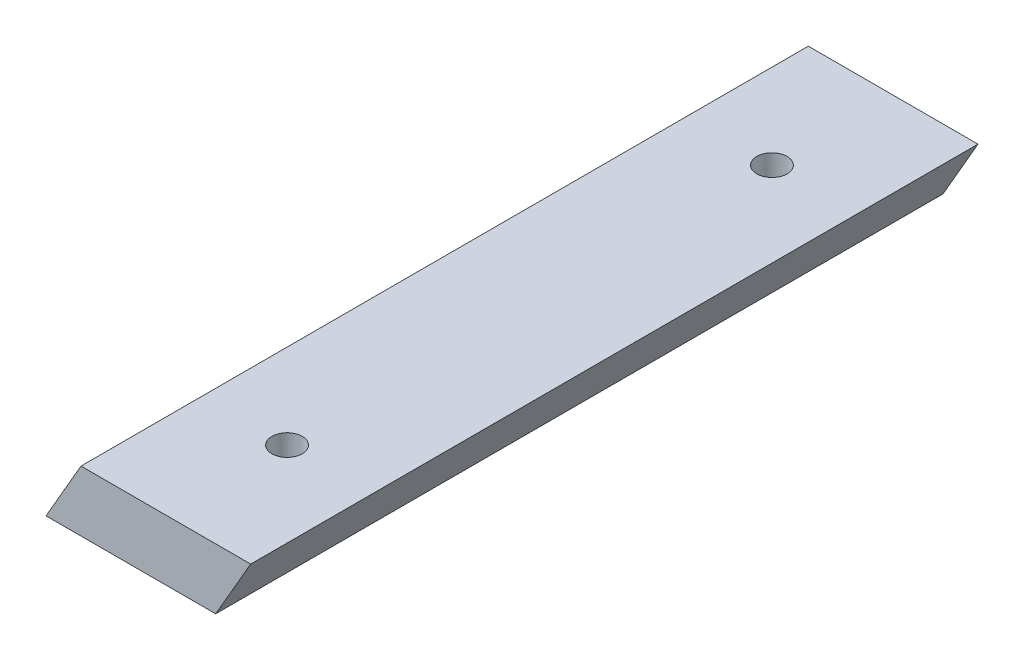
ISO-10303-21;
HEADER;
FILE_DESCRIPTION(('STEP AP214'),'2;1');
FILE_NAME('part.step','',(''),(''),'','','');
FILE_SCHEMA(('AUTOMOTIVE_DESIGN { 1 0 10303 214 1 1 1 1 }'));
ENDSEC;
DATA;
#1=APPLICATION_CONTEXT('core data for automotive mechanical design processes');
#2=APPLICATION_PROTOCOL_DEFINITION('international standard','automotive_design',2000,#1);
#3=PRODUCT_CONTEXT('',#1,'mechanical');
#4=PRODUCT('Part','Part','',(#3));
#5=PRODUCT_RELATED_PRODUCT_CATEGORY('part','',(#4));
#6=PRODUCT_DEFINITION_FORMATION('','',#4);
#7=PRODUCT_DEFINITION_CONTEXT('part definition',#1,'design');
#8=PRODUCT_DEFINITION('design','',#6,#7);
#9=PRODUCT_DEFINITION_SHAPE('','',#8);
#10=(LENGTH_UNIT() NAMED_UNIT(*) SI_UNIT(.MILLI.,.METRE.));
#11=(NAMED_UNIT(*) PLANE_ANGLE_UNIT() SI_UNIT($,.RADIAN.));
#12=(NAMED_UNIT(*) SI_UNIT($,.STERADIAN.) SOLID_ANGLE_UNIT());
#13=UNCERTAINTY_MEASURE_WITH_UNIT(LENGTH_MEASURE(1.E-05),#10,'distance_accuracy_value','');
#14=(GEOMETRIC_REPRESENTATION_CONTEXT(3) GLOBAL_UNCERTAINTY_ASSIGNED_CONTEXT((#13)) GLOBAL_UNIT_ASSIGNED_CONTEXT((#10,
#11,#12)) REPRESENTATION_CONTEXT('',''));
#15=CARTESIAN_POINT('',(0.,0.,0.));
#16=DIRECTION('',(0.,0.,1.));
#17=DIRECTION('',(1.,0.,0.));
#18=AXIS2_PLACEMENT_3D('',#15,#16,#17);
#19=CARTESIAN_POINT('',(0.,-5.,60.));
#20=DIRECTION('',(0.,1.,0.));
#21=DIRECTION('',(0.,0.,1.));
#22=AXIS2_PLACEMENT_3D('',#19,#20,#21);
#23=PLANE('',#22);
#24=DIRECTION('',(1.,0.,0.));
#25=VECTOR('',#24,1.);
#26=CARTESIAN_POINT('',(0.,-5.,-60.));
#27=LINE('',#26,#25);
#28=CARTESIAN_POINT('',(-19.7735026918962,-5.,-60.));
#29=VERTEX_POINT('',#28);
#30=CARTESIAN_POINT('',(8.22649730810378,-5.,-60.));
#31=VERTEX_POINT('',#30);
#32=EDGE_CURVE('E88',#29,#31,#27,.T.);
#33=ORIENTED_EDGE('',*,*,#32,.T.);
#34=DIRECTION('',(0.,0.,-1.));
#35=VECTOR('',#34,1.);
#36=CARTESIAN_POINT('',(8.22649730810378,-5.,60.));
#37=LINE('',#36,#35);
#38=CARTESIAN_POINT('',(8.22649730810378,-5.,60.));
#39=VERTEX_POINT('',#38);
#40=EDGE_CURVE('E44',#39,#31,#37,.T.);
#41=ORIENTED_EDGE('',*,*,#40,.F.);
#42=DIRECTION('',(1.,0.,0.));
#43=VECTOR('',#42,1.);
#44=CARTESIAN_POINT('',(0.,-5.,60.));
#45=LINE('',#44,#43);
#46=CARTESIAN_POINT('',(-19.7735026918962,-5.,60.));
#47=VERTEX_POINT('',#46);
#48=EDGE_CURVE('E78',#47,#39,#45,.T.);
#49=ORIENTED_EDGE('',*,*,#48,.F.);
#50=DIRECTION('',(0.,0.,-1.));
#51=VECTOR('',#50,1.);
#52=CARTESIAN_POINT('',(-19.7735026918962,-5.,60.));
#53=LINE('',#52,#51);
#54=EDGE_CURVE('E11',#47,#29,#53,.T.);
#55=ORIENTED_EDGE('',*,*,#54,.T.);
#56=EDGE_LOOP('',(#33,#41,#49,#55));
#57=FACE_BOUND('',#56,.T.);
#58=CARTESIAN_POINT('',(0.,-5.,40.));
#59=DIRECTION('',(0.,1.,0.));
#60=DIRECTION('',(-1.,0.,0.));
#61=AXIS2_PLACEMENT_3D('',#58,#59,#60);
#62=CIRCLE('',#61,2.5);
#63=CARTESIAN_POINT('',(-2.5,-5.,40.));
#64=VERTEX_POINT('',#63);
#65=EDGE_CURVE('E101',#64,#64,#62,.T.);
#66=ORIENTED_EDGE('',*,*,#65,.T.);
#67=EDGE_LOOP('',(#66));
#68=FACE_BOUND('',#67,.T.);
#69=CARTESIAN_POINT('',(0.,-5.00000000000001,-40.));
#70=DIRECTION('',(0.,-1.,0.));
#71=DIRECTION('',(-1.,0.,0.));
#72=AXIS2_PLACEMENT_3D('',#69,#70,#71);
#73=CIRCLE('',#72,2.5);
#74=CARTESIAN_POINT('',(-2.5,-5.00000000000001,-40.));
#75=VERTEX_POINT('',#74);
#76=EDGE_CURVE('E190',#75,#75,#73,.T.);
#77=ORIENTED_EDGE('',*,*,#76,.F.);
#78=EDGE_LOOP('',(#77));
#79=FACE_BOUND('',#78,.T.);
#80=ADVANCED_FACE('F35',(#57,#68,#79),#23,.F.);
#81=CARTESIAN_POINT('',(0.,5.,60.));
#82=DIRECTION('',(0.,-1.,0.));
#83=DIRECTION('',(1.,0.,0.));
#84=AXIS2_PLACEMENT_3D('',#81,#82,#83);
#85=PLANE('',#84);
#86=DIRECTION('',(-1.,0.,0.));
#87=VECTOR('',#86,1.);
#88=CARTESIAN_POINT('',(0.,5.,-60.));
#89=LINE('',#88,#87);
#90=CARTESIAN_POINT('',(14.,5.,-60.));
#91=VERTEX_POINT('',#90);
#92=CARTESIAN_POINT('',(-14.,5.,-60.));
#93=VERTEX_POINT('',#92);
#94=EDGE_CURVE('E71',#91,#93,#89,.T.);
#95=ORIENTED_EDGE('',*,*,#94,.T.);
#96=DIRECTION('',(0.,0.,-1.));
#97=VECTOR('',#96,1.);
#98=CARTESIAN_POINT('',(-14.,5.,60.));
#99=LINE('',#98,#97);
#100=CARTESIAN_POINT('',(-14.,5.,60.));
#101=VERTEX_POINT('',#100);
#102=EDGE_CURVE('E94',#101,#93,#99,.T.);
#103=ORIENTED_EDGE('',*,*,#102,.F.);
#104=DIRECTION('',(-1.,0.,0.));
#105=VECTOR('',#104,1.);
#106=CARTESIAN_POINT('',(0.,5.,60.));
#107=LINE('',#106,#105);
#108=CARTESIAN_POINT('',(14.,5.,60.));
#109=VERTEX_POINT('',#108);
#110=EDGE_CURVE('E52',#109,#101,#107,.T.);
#111=ORIENTED_EDGE('',*,*,#110,.F.);
#112=DIRECTION('',(0.,0.,-1.));
#113=VECTOR('',#112,1.);
#114=CARTESIAN_POINT('',(14.,5.,60.));
#115=LINE('',#114,#113);
#116=EDGE_CURVE('E68',#109,#91,#115,.T.);
#117=ORIENTED_EDGE('',*,*,#116,.T.);
#118=EDGE_LOOP('',(#95,#103,#111,#117));
#119=FACE_BOUND('',#118,.T.);
#120=CARTESIAN_POINT('',(0.,5.,40.));
#121=DIRECTION('',(0.,1.,0.));
#122=DIRECTION('',(-1.,0.,0.));
#123=AXIS2_PLACEMENT_3D('',#120,#121,#122);
#124=CIRCLE('',#123,2.5);
#125=CARTESIAN_POINT('',(-2.50000000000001,5.,40.));
#126=VERTEX_POINT('',#125);
#127=EDGE_CURVE('E196',#126,#126,#124,.T.);
#128=ORIENTED_EDGE('',*,*,#127,.F.);
#129=EDGE_LOOP('',(#128));
#130=FACE_BOUND('',#129,.T.);
#131=CARTESIAN_POINT('',(0.,5.,-40.));
#132=DIRECTION('',(0.,-1.,0.));
#133=DIRECTION('',(-1.,0.,0.));
#134=AXIS2_PLACEMENT_3D('',#131,#132,#133);
#135=CIRCLE('',#134,2.5);
#136=CARTESIAN_POINT('',(-2.50000000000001,5.,-40.));
#137=VERTEX_POINT('',#136);
#138=EDGE_CURVE('E193',#137,#137,#135,.T.);
#139=ORIENTED_EDGE('',*,*,#138,.T.);
#140=EDGE_LOOP('',(#139));
#141=FACE_BOUND('',#140,.T.);
#142=ADVANCED_FACE('F124',(#119,#130,#141),#85,.F.);
#143=CARTESIAN_POINT('',(-12.6650635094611,7.31217782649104,60.));
#144=DIRECTION('',(0.86602540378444,-0.499999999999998,0.));
#145=DIRECTION('',(0.499999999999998,0.86602540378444,0.));
#146=AXIS2_PLACEMENT_3D('',#143,#144,#145);
#147=PLANE('',#146);
#148=DIRECTION('',(-0.499999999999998,-0.86602540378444,0.));
#149=VECTOR('',#148,1.);
#150=CARTESIAN_POINT('',(-12.6650635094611,7.31217782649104,-60.));
#151=LINE('',#150,#149);
#152=EDGE_CURVE('E98',#93,#29,#151,.T.);
#153=ORIENTED_EDGE('',*,*,#152,.T.);
#154=ORIENTED_EDGE('',*,*,#54,.F.);
#155=DIRECTION('',(-0.499999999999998,-0.86602540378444,0.));
#156=VECTOR('',#155,1.);
#157=CARTESIAN_POINT('',(-12.6650635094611,7.31217782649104,60.));
#158=LINE('',#157,#156);
#159=EDGE_CURVE('E83',#101,#47,#158,.T.);
#160=ORIENTED_EDGE('',*,*,#159,.F.);
#161=ORIENTED_EDGE('',*,*,#102,.T.);
#162=EDGE_LOOP('',(#153,#154,#160,#161));
#163=FACE_BOUND('',#162,.T.);
#164=ADVANCED_FACE('F37',(#163),#147,.F.);
#165=CARTESIAN_POINT('',(8.33493649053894,-4.81217782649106,60.));
#166=DIRECTION('',(0.86602540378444,-0.499999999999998,0.));
#167=DIRECTION('',(0.499999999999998,0.86602540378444,0.));
#168=AXIS2_PLACEMENT_3D('',#165,#166,#167);
#169=PLANE('',#168);
#170=DIRECTION('',(-0.499999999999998,-0.86602540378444,0.));
#171=VECTOR('',#170,1.);
#172=CARTESIAN_POINT('',(8.33493649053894,-4.81217782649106,-60.));
#173=LINE('',#172,#171);
#174=EDGE_CURVE('E103',#91,#31,#173,.T.);
#175=ORIENTED_EDGE('',*,*,#174,.F.);
#176=ORIENTED_EDGE('',*,*,#116,.F.);
#177=DIRECTION('',(-0.499999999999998,-0.86602540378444,0.));
#178=VECTOR('',#177,1.);
#179=CARTESIAN_POINT('',(8.33493649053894,-4.81217782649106,60.));
#180=LINE('',#179,#178);
#181=EDGE_CURVE('E81',#109,#39,#180,.T.);
#182=ORIENTED_EDGE('',*,*,#181,.T.);
#183=ORIENTED_EDGE('',*,*,#40,.T.);
#184=EDGE_LOOP('',(#175,#176,#182,#183));
#185=FACE_BOUND('',#184,.T.);
#186=ADVANCED_FACE('F92',(#185),#169,.T.);
#187=CARTESIAN_POINT('',(0.,0.,60.));
#188=DIRECTION('',(0.,0.,1.));
#189=DIRECTION('',(1.,0.,0.));
#190=AXIS2_PLACEMENT_3D('',#187,#188,#189);
#191=PLANE('',#190);
#192=ORIENTED_EDGE('',*,*,#159,.T.);
#193=ORIENTED_EDGE('',*,*,#48,.T.);
#194=ORIENTED_EDGE('',*,*,#181,.F.);
#195=ORIENTED_EDGE('',*,*,#110,.T.);
#196=EDGE_LOOP('',(#192,#193,#194,#195));
#197=FACE_BOUND('',#196,.T.);
#198=ADVANCED_FACE('F79',(#197),#191,.T.);
#199=CARTESIAN_POINT('',(0.,0.,-60.));
#200=DIRECTION('',(0.,0.,1.));
#201=DIRECTION('',(1.,0.,0.));
#202=AXIS2_PLACEMENT_3D('',#199,#200,#201);
#203=PLANE('',#202);
#204=ORIENTED_EDGE('',*,*,#152,.F.);
#205=ORIENTED_EDGE('',*,*,#94,.F.);
#206=ORIENTED_EDGE('',*,*,#174,.T.);
#207=ORIENTED_EDGE('',*,*,#32,.F.);
#208=EDGE_LOOP('',(#204,#205,#206,#207));
#209=FACE_BOUND('',#208,.T.);
#210=ADVANCED_FACE('F110',(#209),#203,.F.);
#211=CARTESIAN_POINT('',(0.,-5.,40.));
#212=DIRECTION('',(0.,1.,0.));
#213=DIRECTION('',(-1.,0.,0.));
#214=AXIS2_PLACEMENT_3D('',#211,#212,#213);
#215=CYLINDRICAL_SURFACE('',#214,2.5);
#216=ORIENTED_EDGE('',*,*,#65,.F.);
#217=EDGE_LOOP('',(#216));
#218=FACE_BOUND('',#217,.T.);
#219=ORIENTED_EDGE('',*,*,#127,.T.);
#220=EDGE_LOOP('',(#219));
#221=FACE_BOUND('',#220,.T.);
#222=ADVANCED_FACE('F112',(#218,#221),#215,.F.);
#223=CARTESIAN_POINT('',(0.,-5.00000000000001,-40.));
#224=DIRECTION('',(0.,1.,0.));
#225=DIRECTION('',(-1.,0.,0.));
#226=AXIS2_PLACEMENT_3D('',#223,#224,#225);
#227=CYLINDRICAL_SURFACE('',#226,2.5);
#228=ORIENTED_EDGE('',*,*,#76,.T.);
#229=EDGE_LOOP('',(#228));
#230=FACE_BOUND('',#229,.T.);
#231=ORIENTED_EDGE('',*,*,#138,.F.);
#232=EDGE_LOOP('',(#231));
#233=FACE_BOUND('',#232,.T.);
#234=ADVANCED_FACE('F118',(#230,#233),#227,.F.);
#235=CLOSED_SHELL('',(#80,#142,#164,#186,#198,#210,#222,#234));
#236=MANIFOLD_SOLID_BREP('B2',#235);
#237=ADVANCED_BREP_SHAPE_REPRESENTATION('',(#18,#236),#14);
#238=SHAPE_DEFINITION_REPRESENTATION(#9,#237);
ENDSEC;
END-ISO-10303-21;
